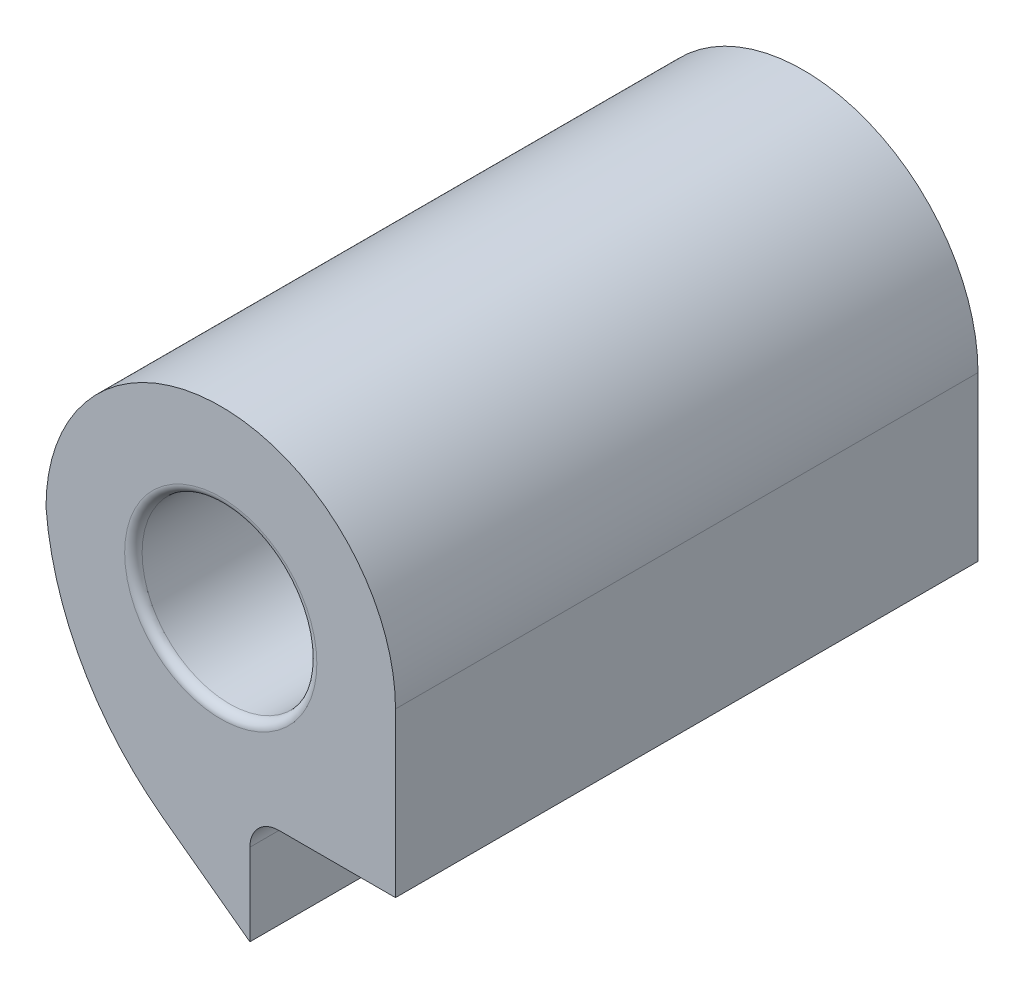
ISO-10303-21;
HEADER;
FILE_DESCRIPTION(('STEP AP214'),'2;1');
FILE_NAME('part.step','',(''),(''),'','','');
FILE_SCHEMA(('AUTOMOTIVE_DESIGN { 1 0 10303 214 1 1 1 1 }'));
ENDSEC;
DATA;
#1=APPLICATION_CONTEXT('core data for automotive mechanical design processes');
#2=APPLICATION_PROTOCOL_DEFINITION('international standard','automotive_design',2000,#1);
#3=PRODUCT_CONTEXT('',#1,'mechanical');
#4=PRODUCT('Part','Part','',(#3));
#5=PRODUCT_RELATED_PRODUCT_CATEGORY('part','',(#4));
#6=PRODUCT_DEFINITION_FORMATION('','',#4);
#7=PRODUCT_DEFINITION_CONTEXT('part definition',#1,'design');
#8=PRODUCT_DEFINITION('design','',#6,#7);
#9=PRODUCT_DEFINITION_SHAPE('','',#8);
#10=(LENGTH_UNIT() NAMED_UNIT(*) SI_UNIT(.MILLI.,.METRE.));
#11=(NAMED_UNIT(*) PLANE_ANGLE_UNIT() SI_UNIT($,.RADIAN.));
#12=(NAMED_UNIT(*) SI_UNIT($,.STERADIAN.) SOLID_ANGLE_UNIT());
#13=UNCERTAINTY_MEASURE_WITH_UNIT(LENGTH_MEASURE(1.E-05),#10,'distance_accuracy_value','');
#14=(GEOMETRIC_REPRESENTATION_CONTEXT(3) GLOBAL_UNCERTAINTY_ASSIGNED_CONTEXT((#13)) GLOBAL_UNIT_ASSIGNED_CONTEXT((#10,
#11,#12)) REPRESENTATION_CONTEXT('',''));
#15=CARTESIAN_POINT('',(0.,0.,0.));
#16=DIRECTION('',(0.,0.,1.));
#17=DIRECTION('',(1.,0.,0.));
#18=AXIS2_PLACEMENT_3D('',#15,#16,#17);
#19=CARTESIAN_POINT('',(0.,0.,20.));
#20=DIRECTION('',(1.,0.,0.));
#21=DIRECTION('',(0.,1.,0.));
#22=AXIS2_PLACEMENT_3D('',#19,#20,#21);
#23=PLANE('',#22);
#24=DIRECTION('',(0.,-1.,0.));
#25=VECTOR('',#24,1.);
#26=CARTESIAN_POINT('',(0.,0.,20.));
#27=LINE('',#26,#25);
#28=CARTESIAN_POINT('',(0.,13.1115219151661,20.));
#29=VERTEX_POINT('',#28);
#30=CARTESIAN_POINT('',(0.,7.5,20.));
#31=VERTEX_POINT('',#30);
#32=EDGE_CURVE('E109',#29,#31,#27,.T.);
#33=ORIENTED_EDGE('',*,*,#32,.T.);
#34=DIRECTION('',(0.,0.,-1.));
#35=VECTOR('',#34,1.);
#36=CARTESIAN_POINT('',(0.,7.5,82.6922213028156));
#37=LINE('',#36,#35);
#38=CARTESIAN_POINT('',(0.,7.5,0.));
#39=VERTEX_POINT('',#38);
#40=EDGE_CURVE('E204',#31,#39,#37,.T.);
#41=ORIENTED_EDGE('',*,*,#40,.T.);
#42=DIRECTION('',(0.,-1.,0.));
#43=VECTOR('',#42,1.);
#44=CARTESIAN_POINT('',(0.,0.,0.));
#45=LINE('',#44,#43);
#46=CARTESIAN_POINT('',(0.,13.1115219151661,0.));
#47=VERTEX_POINT('',#46);
#48=EDGE_CURVE('E112',#47,#39,#45,.T.);
#49=ORIENTED_EDGE('',*,*,#48,.F.);
#50=DIRECTION('',(0.,0.,-1.));
#51=VECTOR('',#50,1.);
#52=CARTESIAN_POINT('',(0.,13.1115219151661,20.));
#53=LINE('',#52,#51);
#54=EDGE_CURVE('E105',#29,#47,#53,.T.);
#55=ORIENTED_EDGE('',*,*,#54,.F.);
#56=EDGE_LOOP('',(#33,#41,#49,#55));
#57=FACE_BOUND('',#56,.T.);
#58=ADVANCED_FACE('F46',(#57),#23,.T.);
#59=CARTESIAN_POINT('',(0.,0.,20.));
#60=DIRECTION('',(0.,0.,1.));
#61=DIRECTION('',(1.,0.,0.));
#62=AXIS2_PLACEMENT_3D('',#59,#60,#61);
#63=PLANE('',#62);
#64=CARTESIAN_POINT('',(-6.,13.1115219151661,20.));
#65=DIRECTION('',(0.,0.,1.));
#66=DIRECTION('',(1.,0.,0.));
#67=AXIS2_PLACEMENT_3D('',#64,#65,#66);
#68=CIRCLE('',#67,3.3);
#69=CARTESIAN_POINT('',(-2.7,13.1115219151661,20.));
#70=VERTEX_POINT('',#69);
#71=EDGE_CURVE('E171',#70,#70,#68,.F.);
#72=ORIENTED_EDGE('',*,*,#71,.T.);
#73=EDGE_LOOP('',(#72));
#74=FACE_BOUND('',#73,.T.);
#75=DIRECTION('',(0.,1.,0.));
#76=VECTOR('',#75,1.);
#77=CARTESIAN_POINT('',(-5.,0.,20.));
#78=LINE('',#77,#76);
#79=CARTESIAN_POINT('',(-5.,3.68622772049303,20.));
#80=VERTEX_POINT('',#79);
#81=CARTESIAN_POINT('',(-5.,6.5,20.));
#82=VERTEX_POINT('',#81);
#83=EDGE_CURVE('E198',#80,#82,#78,.T.);
#84=ORIENTED_EDGE('',*,*,#83,.T.);
#85=CARTESIAN_POINT('',(-4.,6.5,20.));
#86=DIRECTION('',(0.,0.,1.));
#87=DIRECTION('',(1.,0.,0.));
#88=AXIS2_PLACEMENT_3D('',#85,#86,#87);
#89=CIRCLE('',#88,1.);
#90=CARTESIAN_POINT('',(-4.,7.5,20.));
#91=VERTEX_POINT('',#90);
#92=EDGE_CURVE('E11',#82,#91,#89,.F.);
#93=ORIENTED_EDGE('',*,*,#92,.T.);
#94=DIRECTION('',(1.,0.,0.));
#95=VECTOR('',#94,1.);
#96=CARTESIAN_POINT('',(0.,7.5,20.));
#97=LINE('',#96,#95);
#98=EDGE_CURVE('E132',#91,#31,#97,.T.);
#99=ORIENTED_EDGE('',*,*,#98,.T.);
#100=ORIENTED_EDGE('',*,*,#32,.F.);
#101=CARTESIAN_POINT('',(-6.,13.1115219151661,20.));
#102=DIRECTION('',(0.,0.,1.));
#103=DIRECTION('',(1.,0.,0.));
#104=AXIS2_PLACEMENT_3D('',#101,#102,#103);
#105=CIRCLE('',#104,6.);
#106=CARTESIAN_POINT('',(-12.,13.1115219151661,20.));
#107=VERTEX_POINT('',#106);
#108=EDGE_CURVE('E121',#29,#107,#105,.T.);
#109=ORIENTED_EDGE('',*,*,#108,.T.);
#110=CARTESIAN_POINT('',(-2.03295298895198,13.9226778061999,20.));
#111=DIRECTION('',(0.,0.,1.));
#112=DIRECTION('',(1.,0.,0.));
#113=AXIS2_PLACEMENT_3D('',#110,#111,#112);
#114=CIRCLE('',#113,10.);
#115=CARTESIAN_POINT('',(-7.96704777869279,5.87367047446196,20.));
#116=VERTEX_POINT('',#115);
#117=EDGE_CURVE('E156',#107,#116,#114,.T.);
#118=ORIENTED_EDGE('',*,*,#117,.T.);
#119=DIRECTION('',(-0.804900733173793,0.593409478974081,0.));
#120=VECTOR('',#119,1.);
#121=CARTESIAN_POINT('',(0.,0.,20.));
#122=LINE('',#121,#120);
#123=EDGE_CURVE('E128',#80,#116,#122,.T.);
#124=ORIENTED_EDGE('',*,*,#123,.F.);
#125=EDGE_LOOP('',(#84,#93,#99,#100,#109,#118,#124));
#126=FACE_BOUND('',#125,.T.);
#127=ADVANCED_FACE('F130',(#74,#126),#63,.T.);
#128=CARTESIAN_POINT('',(0.,0.,0.));
#129=DIRECTION('',(0.,0.,1.));
#130=DIRECTION('',(1.,0.,0.));
#131=AXIS2_PLACEMENT_3D('',#128,#129,#130);
#132=PLANE('',#131);
#133=CARTESIAN_POINT('',(-6.,13.1115219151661,0.));
#134=DIRECTION('',(0.,0.,1.));
#135=DIRECTION('',(1.,0.,0.));
#136=AXIS2_PLACEMENT_3D('',#133,#134,#135);
#137=CIRCLE('',#136,3.3);
#138=CARTESIAN_POINT('',(-2.7,13.1115219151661,0.));
#139=VERTEX_POINT('',#138);
#140=EDGE_CURVE('E159',#139,#139,#137,.T.);
#141=ORIENTED_EDGE('',*,*,#140,.T.);
#142=EDGE_LOOP('',(#141));
#143=FACE_BOUND('',#142,.T.);
#144=DIRECTION('',(1.,0.,0.));
#145=VECTOR('',#144,1.);
#146=CARTESIAN_POINT('',(0.,7.5,0.));
#147=LINE('',#146,#145);
#148=CARTESIAN_POINT('',(-4.,7.5,0.));
#149=VERTEX_POINT('',#148);
#150=EDGE_CURVE('E178',#149,#39,#147,.T.);
#151=ORIENTED_EDGE('',*,*,#150,.F.);
#152=CARTESIAN_POINT('',(-4.,6.5,0.));
#153=DIRECTION('',(0.,0.,1.));
#154=DIRECTION('',(1.,0.,0.));
#155=AXIS2_PLACEMENT_3D('',#152,#153,#154);
#156=CIRCLE('',#155,1.);
#157=CARTESIAN_POINT('',(-5.,6.5,0.));
#158=VERTEX_POINT('',#157);
#159=EDGE_CURVE('E55',#149,#158,#156,.T.);
#160=ORIENTED_EDGE('',*,*,#159,.T.);
#161=DIRECTION('',(0.,1.,0.));
#162=VECTOR('',#161,1.);
#163=CARTESIAN_POINT('',(-5.,0.,0.));
#164=LINE('',#163,#162);
#165=CARTESIAN_POINT('',(-5.,3.68622772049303,0.));
#166=VERTEX_POINT('',#165);
#167=EDGE_CURVE('E175',#166,#158,#164,.T.);
#168=ORIENTED_EDGE('',*,*,#167,.F.);
#169=DIRECTION('',(-0.804900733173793,0.593409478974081,0.));
#170=VECTOR('',#169,1.);
#171=CARTESIAN_POINT('',(0.,0.,0.));
#172=LINE('',#171,#170);
#173=CARTESIAN_POINT('',(-7.96704777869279,5.87367047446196,0.));
#174=VERTEX_POINT('',#173);
#175=EDGE_CURVE('E134',#166,#174,#172,.T.);
#176=ORIENTED_EDGE('',*,*,#175,.T.);
#177=CARTESIAN_POINT('',(-2.03295298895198,13.9226778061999,0.));
#178=DIRECTION('',(0.,0.,1.));
#179=DIRECTION('',(1.,0.,0.));
#180=AXIS2_PLACEMENT_3D('',#177,#178,#179);
#181=CIRCLE('',#180,10.);
#182=CARTESIAN_POINT('',(-12.,13.1115219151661,0.));
#183=VERTEX_POINT('',#182);
#184=EDGE_CURVE('E153',#174,#183,#181,.F.);
#185=ORIENTED_EDGE('',*,*,#184,.T.);
#186=CARTESIAN_POINT('',(-6.,13.1115219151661,0.));
#187=DIRECTION('',(0.,0.,1.));
#188=DIRECTION('',(1.,0.,0.));
#189=AXIS2_PLACEMENT_3D('',#186,#187,#188);
#190=CIRCLE('',#189,6.);
#191=EDGE_CURVE('E137',#47,#183,#190,.T.);
#192=ORIENTED_EDGE('',*,*,#191,.F.);
#193=ORIENTED_EDGE('',*,*,#48,.T.);
#194=EDGE_LOOP('',(#151,#160,#168,#176,#185,#192,#193));
#195=FACE_BOUND('',#194,.T.);
#196=ADVANCED_FACE('F192',(#143,#195),#132,.F.);
#197=CARTESIAN_POINT('',(-6.,13.1115219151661,20.));
#198=DIRECTION('',(0.,0.,-1.));
#199=DIRECTION('',(-1.,0.,0.));
#200=AXIS2_PLACEMENT_3D('',#197,#198,#199);
#201=CYLINDRICAL_SURFACE('',#200,6.);
#202=ORIENTED_EDGE('',*,*,#191,.T.);
#203=DIRECTION('',(0.,0.,-1.));
#204=VECTOR('',#203,1.);
#205=CARTESIAN_POINT('',(-12.,13.1115219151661,20.));
#206=LINE('',#205,#204);
#207=EDGE_CURVE('E118',#107,#183,#206,.T.);
#208=ORIENTED_EDGE('',*,*,#207,.F.);
#209=ORIENTED_EDGE('',*,*,#108,.F.);
#210=ORIENTED_EDGE('',*,*,#54,.T.);
#211=EDGE_LOOP('',(#202,#208,#209,#210));
#212=FACE_BOUND('',#211,.T.);
#213=ADVANCED_FACE('F122',(#212),#201,.T.);
#214=CARTESIAN_POINT('',(-6.,13.1115219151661,20.));
#215=DIRECTION('',(0.,0.,-1.));
#216=DIRECTION('',(-1.,0.,0.));
#217=AXIS2_PLACEMENT_3D('',#214,#215,#216);
#218=CYLINDRICAL_SURFACE('',#217,3.);
#219=CARTESIAN_POINT('',(-6.,13.1115219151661,0.300000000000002));
#220=DIRECTION('',(0.,0.,1.));
#221=DIRECTION('',(1.,0.,0.));
#222=AXIS2_PLACEMENT_3D('',#219,#220,#221);
#223=CIRCLE('',#222,3.);
#224=CARTESIAN_POINT('',(-3.,13.1115219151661,0.300000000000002));
#225=VERTEX_POINT('',#224);
#226=EDGE_CURVE('E167',#225,#225,#223,.F.);
#227=ORIENTED_EDGE('',*,*,#226,.T.);
#228=EDGE_LOOP('',(#227));
#229=FACE_BOUND('',#228,.T.);
#230=CARTESIAN_POINT('',(-6.,13.1115219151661,19.7));
#231=DIRECTION('',(0.,0.,1.));
#232=DIRECTION('',(1.,0.,0.));
#233=AXIS2_PLACEMENT_3D('',#230,#231,#232);
#234=CIRCLE('',#233,3.);
#235=CARTESIAN_POINT('',(-3.,13.1115219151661,19.7));
#236=VERTEX_POINT('',#235);
#237=EDGE_CURVE('E163',#236,#236,#234,.T.);
#238=ORIENTED_EDGE('',*,*,#237,.T.);
#239=EDGE_LOOP('',(#238));
#240=FACE_BOUND('',#239,.T.);
#241=ADVANCED_FACE('F213',(#229,#240),#218,.F.);
#242=CARTESIAN_POINT('',(0.,0.,20.));
#243=DIRECTION('',(-0.593409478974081,-0.804900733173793,0.));
#244=DIRECTION('',(0.804900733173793,-0.593409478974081,0.));
#245=AXIS2_PLACEMENT_3D('',#242,#243,#244);
#246=PLANE('',#245);
#247=DIRECTION('',(0.,0.,-1.));
#248=VECTOR('',#247,1.);
#249=CARTESIAN_POINT('',(-5.,3.68622772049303,82.6922213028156));
#250=LINE('',#249,#248);
#251=EDGE_CURVE('E202',#80,#166,#250,.T.);
#252=ORIENTED_EDGE('',*,*,#251,.F.);
#253=ORIENTED_EDGE('',*,*,#123,.T.);
#254=DIRECTION('',(0.,0.,1.));
#255=VECTOR('',#254,1.);
#256=CARTESIAN_POINT('',(-7.96704777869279,5.87367047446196,0.));
#257=LINE('',#256,#255);
#258=EDGE_CURVE('E117',#116,#174,#257,.F.);
#259=ORIENTED_EDGE('',*,*,#258,.T.);
#260=ORIENTED_EDGE('',*,*,#175,.F.);
#261=EDGE_LOOP('',(#252,#253,#259,#260));
#262=FACE_BOUND('',#261,.T.);
#263=ADVANCED_FACE('F211',(#262),#246,.T.);
#264=CARTESIAN_POINT('',(-2.03295298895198,13.9226778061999,20.));
#265=DIRECTION('',(0.,0.,-1.));
#266=DIRECTION('',(-1.,0.,0.));
#267=AXIS2_PLACEMENT_3D('',#264,#265,#266);
#268=CYLINDRICAL_SURFACE('',#267,10.);
#269=ORIENTED_EDGE('',*,*,#117,.F.);
#270=ORIENTED_EDGE('',*,*,#207,.T.);
#271=ORIENTED_EDGE('',*,*,#184,.F.);
#272=ORIENTED_EDGE('',*,*,#258,.F.);
#273=EDGE_LOOP('',(#269,#270,#271,#272));
#274=FACE_BOUND('',#273,.T.);
#275=ADVANCED_FACE('F195',(#274),#268,.T.);
#276=CARTESIAN_POINT('',(-6.,13.1115219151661,0.300000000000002));
#277=DIRECTION('',(0.,0.,1.));
#278=DIRECTION('',(1.,0.,0.));
#279=AXIS2_PLACEMENT_3D('',#276,#277,#278);
#280=TOROIDAL_SURFACE('',#279,3.3,0.3);
#281=ORIENTED_EDGE('',*,*,#226,.F.);
#282=EDGE_LOOP('',(#281));
#283=FACE_BOUND('',#282,.T.);
#284=ORIENTED_EDGE('',*,*,#140,.F.);
#285=EDGE_LOOP('',(#284));
#286=FACE_BOUND('',#285,.T.);
#287=ADVANCED_FACE('F220',(#283,#286),#280,.T.);
#288=CARTESIAN_POINT('',(-6.,13.1115219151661,19.7));
#289=DIRECTION('',(0.,0.,1.));
#290=DIRECTION('',(1.,0.,0.));
#291=AXIS2_PLACEMENT_3D('',#288,#289,#290);
#292=TOROIDAL_SURFACE('',#291,3.3,0.3);
#293=ORIENTED_EDGE('',*,*,#71,.F.);
#294=EDGE_LOOP('',(#293));
#295=FACE_BOUND('',#294,.T.);
#296=ORIENTED_EDGE('',*,*,#237,.F.);
#297=EDGE_LOOP('',(#296));
#298=FACE_BOUND('',#297,.T.);
#299=ADVANCED_FACE('F235',(#295,#298),#292,.T.);
#300=CARTESIAN_POINT('',(0.,7.5,82.6922213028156));
#301=DIRECTION('',(0.,-1.,0.));
#302=DIRECTION('',(1.,0.,0.));
#303=AXIS2_PLACEMENT_3D('',#300,#301,#302);
#304=PLANE('',#303);
#305=ORIENTED_EDGE('',*,*,#98,.F.);
#306=DIRECTION('',(0.,0.,-1.));
#307=VECTOR('',#306,1.);
#308=CARTESIAN_POINT('',(-4.,7.5,0.));
#309=LINE('',#308,#307);
#310=EDGE_CURVE('E181',#91,#149,#309,.T.);
#311=ORIENTED_EDGE('',*,*,#310,.T.);
#312=ORIENTED_EDGE('',*,*,#150,.T.);
#313=ORIENTED_EDGE('',*,*,#40,.F.);
#314=EDGE_LOOP('',(#305,#311,#312,#313));
#315=FACE_BOUND('',#314,.T.);
#316=ADVANCED_FACE('F189',(#315),#304,.T.);
#317=CARTESIAN_POINT('',(-5.,7.5,82.6922213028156));
#318=DIRECTION('',(1.,0.,0.));
#319=DIRECTION('',(0.,0.,-1.));
#320=AXIS2_PLACEMENT_3D('',#317,#318,#319);
#321=PLANE('',#320);
#322=ORIENTED_EDGE('',*,*,#167,.T.);
#323=DIRECTION('',(0.,0.,-1.));
#324=VECTOR('',#323,1.);
#325=CARTESIAN_POINT('',(-5.,6.5,20.));
#326=LINE('',#325,#324);
#327=EDGE_CURVE('E68',#158,#82,#326,.F.);
#328=ORIENTED_EDGE('',*,*,#327,.T.);
#329=ORIENTED_EDGE('',*,*,#83,.F.);
#330=ORIENTED_EDGE('',*,*,#251,.T.);
#331=EDGE_LOOP('',(#322,#328,#329,#330));
#332=FACE_BOUND('',#331,.T.);
#333=ADVANCED_FACE('F201',(#332),#321,.T.);
#334=CARTESIAN_POINT('',(-4.,6.5,82.6922213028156));
#335=DIRECTION('',(0.,0.,1.));
#336=DIRECTION('',(1.,0.,0.));
#337=AXIS2_PLACEMENT_3D('',#334,#335,#336);
#338=CYLINDRICAL_SURFACE('',#337,1.);
#339=ORIENTED_EDGE('',*,*,#92,.F.);
#340=ORIENTED_EDGE('',*,*,#327,.F.);
#341=ORIENTED_EDGE('',*,*,#159,.F.);
#342=ORIENTED_EDGE('',*,*,#310,.F.);
#343=EDGE_LOOP('',(#339,#340,#341,#342));
#344=FACE_BOUND('',#343,.T.);
#345=ADVANCED_FACE('F48',(#344),#338,.F.);
#346=CLOSED_SHELL('',(#58,#127,#196,#213,#241,#263,#275,#287,#299,#316,#333,#345));
#347=MANIFOLD_SOLID_BREP('B2',#346);
#348=ADVANCED_BREP_SHAPE_REPRESENTATION('',(#18,#347),#14);
#349=SHAPE_DEFINITION_REPRESENTATION(#9,#348);
ENDSEC;
END-ISO-10303-21;
